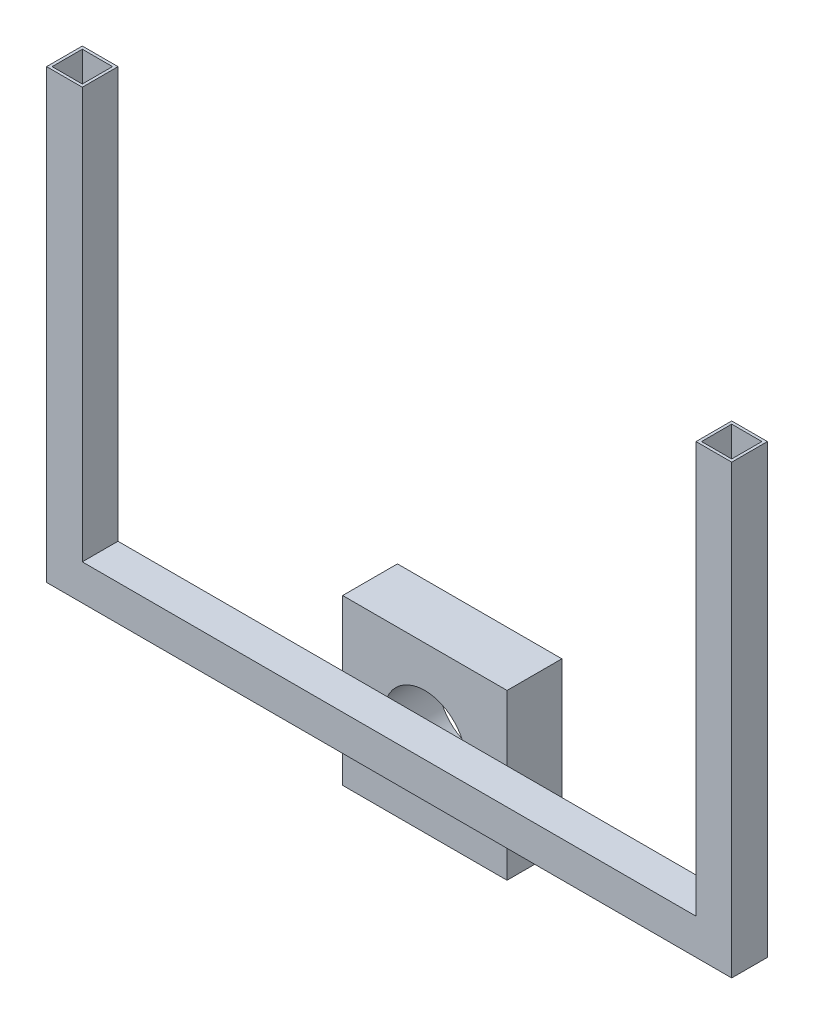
from build123d import *

# Parameters (mm, degrees)
SKETCH1_W           = 250
SKETCH1_H           = 13.022
BOSS_EXTRUDE1_DEPTH = 13.022
SKETCH2_W           = 13.022
SKETCH2_H           = 13.022
BOSS_EXTRUDE2_DEPTH = 150
SKETCH3_W           = 60
SKETCH3_H           = 60
BOSS_EXTRUDE3_DEPTH = 20
SKETCH4_R           = 15
CUT_EXTRUDE1_DEPTH  = 20
SKETCH5_W           = 11.015657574
SKETCH5_H           = 11.015657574
CUT_EXTRUDE2_DEPTH  = 160


with BuildPart() as part:
    # Sketch1 → Boss-Extrude1 (new body)
    with BuildSketch(Plane(origin=(0, 0, 0), x_dir=(1, 0, 0), z_dir=(0, 1, 0))):
        with Locations((125, 6.511)):
            Rectangle(SKETCH1_W, SKETCH1_H)
    extrude(amount=BOSS_EXTRUDE1_DEPTH)

    # Sketch2 → Boss-Extrude2 (add)
    with BuildSketch(Plane(origin=(0, 13.022, 0), x_dir=(1, 0, 0), z_dir=(0, 1, 0))):
        with Locations((6.511, 6.511)):
            Rectangle(SKETCH2_W, SKETCH2_H)
        with Locations((243.489, 6.511)):
            Rectangle(SKETCH2_W, SKETCH2_H)
    extrude(amount=BOSS_EXTRUDE2_DEPTH)

    # Sketch3 → Boss-Extrude3 (add)
    with BuildSketch(Plane(origin=(0, 0, -13.022), x_dir=(-1, 0, 0), z_dir=(0, 0, -1))):
        with Locations((-125, 6.868781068)):
            Rectangle(SKETCH3_W, SKETCH3_H)
    extrude(amount=BOSS_EXTRUDE3_DEPTH)

    # Sketch4 → Cut-Extrude1 (cut)
    with BuildSketch(Plane(origin=(0, 0, -33.022), x_dir=(-1, 0, 0), z_dir=(0, 0, -1))):
        with Locations((-125, 6.868781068)):
            Circle(SKETCH4_R)
    extrude(amount=-CUT_EXTRUDE1_DEPTH, mode=Mode.SUBTRACT)

    # Sketch5 → Cut-Extrude2 (cut)
    with BuildSketch(Plane(origin=(0, 163.022, 0), x_dir=(1, 0, 0), z_dir=(0, 1, 0))):
        with Locations((243.489, 6.511)):
            Rectangle(SKETCH5_W, SKETCH5_H)
        with Locations((6.511, 6.511)):
            Rectangle(SKETCH5_W, SKETCH5_H)
    extrude(amount=-CUT_EXTRUDE2_DEPTH, mode=Mode.SUBTRACT)


solid = part.part
